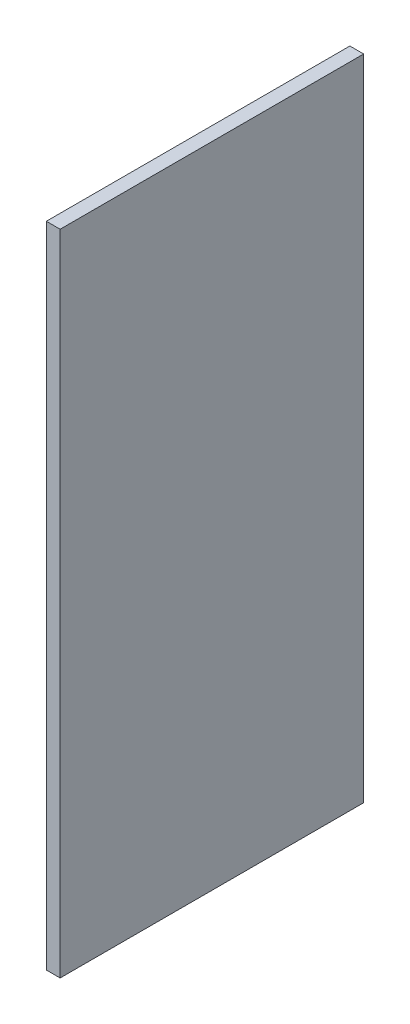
from build123d import *

# Parameters (mm, degrees)
ESQUISSE1_W          = 5
ESQUISSE1_H          = 235
BASE_EXTRUSION_DEPTH = 110


with BuildPart() as part:
    # Esquisse1 → Base-Extrusion (new body)
    with BuildSketch(Plane.XY):
        with Locations((-29.283188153, -53.933623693)):
            Rectangle(ESQUISSE1_W, ESQUISSE1_H)
    extrude(amount=BASE_EXTRUSION_DEPTH)


solid = part.part
